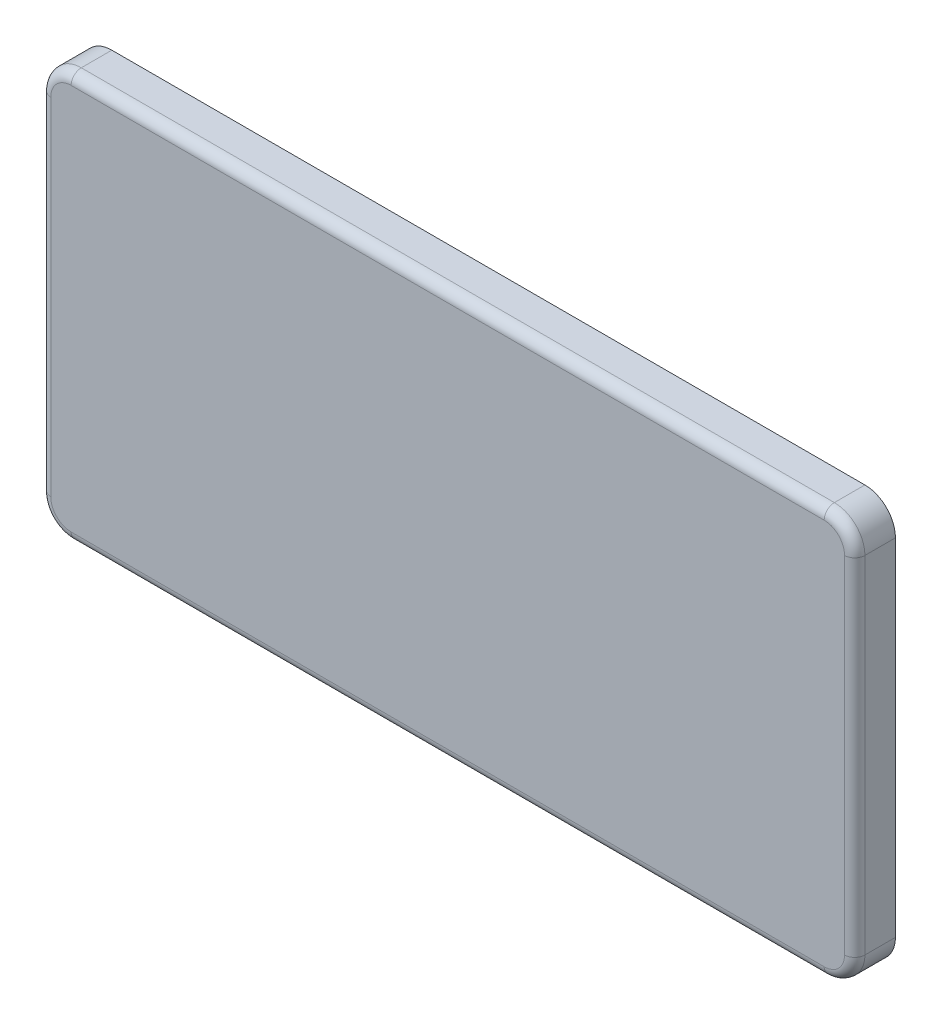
ISO-10303-21;
HEADER;
FILE_DESCRIPTION(('STEP AP214'),'2;1');
FILE_NAME('part.step','',(''),(''),'','','');
FILE_SCHEMA(('AUTOMOTIVE_DESIGN { 1 0 10303 214 1 1 1 1 }'));
ENDSEC;
DATA;
#1=APPLICATION_CONTEXT('core data for automotive mechanical design processes');
#2=APPLICATION_PROTOCOL_DEFINITION('international standard','automotive_design',2000,#1);
#3=PRODUCT_CONTEXT('',#1,'mechanical');
#4=PRODUCT('Part','Part','',(#3));
#5=PRODUCT_RELATED_PRODUCT_CATEGORY('part','',(#4));
#6=PRODUCT_DEFINITION_FORMATION('','',#4);
#7=PRODUCT_DEFINITION_CONTEXT('part definition',#1,'design');
#8=PRODUCT_DEFINITION('design','',#6,#7);
#9=PRODUCT_DEFINITION_SHAPE('','',#8);
#10=(LENGTH_UNIT() NAMED_UNIT(*) SI_UNIT(.MILLI.,.METRE.));
#11=(NAMED_UNIT(*) PLANE_ANGLE_UNIT() SI_UNIT($,.RADIAN.));
#12=(NAMED_UNIT(*) SI_UNIT($,.STERADIAN.) SOLID_ANGLE_UNIT());
#13=UNCERTAINTY_MEASURE_WITH_UNIT(LENGTH_MEASURE(1.E-05),#10,'distance_accuracy_value','');
#14=(GEOMETRIC_REPRESENTATION_CONTEXT(3) GLOBAL_UNCERTAINTY_ASSIGNED_CONTEXT((#13)) GLOBAL_UNIT_ASSIGNED_CONTEXT((#10,
#11,#12)) REPRESENTATION_CONTEXT('',''));
#15=CARTESIAN_POINT('',(0.,0.,0.));
#16=DIRECTION('',(0.,0.,1.));
#17=DIRECTION('',(1.,0.,0.));
#18=AXIS2_PLACEMENT_3D('',#15,#16,#17);
#19=CARTESIAN_POINT('',(57.,-17.,4.));
#20=DIRECTION('',(0.,0.,-1.));
#21=DIRECTION('',(-1.,0.,0.));
#22=AXIS2_PLACEMENT_3D('',#19,#20,#21);
#23=CYLINDRICAL_SURFACE('',#22,3.);
#24=DIRECTION('',(0.,0.,-1.));
#25=VECTOR('',#24,1.);
#26=CARTESIAN_POINT('',(60.0000000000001,-17.,4.));
#27=LINE('',#26,#25);
#28=CARTESIAN_POINT('',(60.0000000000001,-17.,3.));
#29=VERTEX_POINT('',#28);
#30=CARTESIAN_POINT('',(60.0000000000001,-17.,0.));
#31=VERTEX_POINT('',#30);
#32=EDGE_CURVE('E118',#29,#31,#27,.T.);
#33=ORIENTED_EDGE('',*,*,#32,.F.);
#34=CARTESIAN_POINT('',(57.,-17.,3.));
#35=DIRECTION('',(0.,0.,1.));
#36=DIRECTION('',(1.,0.,0.));
#37=AXIS2_PLACEMENT_3D('',#34,#35,#36);
#38=CIRCLE('',#37,3.);
#39=CARTESIAN_POINT('',(57.,-20.,3.));
#40=VERTEX_POINT('',#39);
#41=EDGE_CURVE('E11',#29,#40,#38,.F.);
#42=ORIENTED_EDGE('',*,*,#41,.T.);
#43=DIRECTION('',(0.,0.,-1.));
#44=VECTOR('',#43,1.);
#45=CARTESIAN_POINT('',(57.,-20.,4.));
#46=LINE('',#45,#44);
#47=CARTESIAN_POINT('',(57.,-20.,0.));
#48=VERTEX_POINT('',#47);
#49=EDGE_CURVE('E139',#40,#48,#46,.T.);
#50=ORIENTED_EDGE('',*,*,#49,.T.);
#51=CARTESIAN_POINT('',(57.,-17.,0.));
#52=DIRECTION('',(0.,0.,1.));
#53=DIRECTION('',(1.,0.,0.));
#54=AXIS2_PLACEMENT_3D('',#51,#52,#53);
#55=CIRCLE('',#54,3.);
#56=EDGE_CURVE('E133',#48,#31,#55,.T.);
#57=ORIENTED_EDGE('',*,*,#56,.T.);
#58=EDGE_LOOP('',(#33,#42,#50,#57));
#59=FACE_BOUND('',#58,.T.);
#60=ADVANCED_FACE('F30',(#59),#23,.T.);
#61=CARTESIAN_POINT('',(60.0000000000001,17.,4.));
#62=DIRECTION('',(-1.,0.,0.));
#63=DIRECTION('',(0.,0.,1.));
#64=AXIS2_PLACEMENT_3D('',#61,#62,#63);
#65=PLANE('',#64);
#66=DIRECTION('',(0.,0.,-1.));
#67=VECTOR('',#66,1.);
#68=CARTESIAN_POINT('',(60.0000000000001,17.,4.));
#69=LINE('',#68,#67);
#70=CARTESIAN_POINT('',(60.0000000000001,17.,3.));
#71=VERTEX_POINT('',#70);
#72=CARTESIAN_POINT('',(60.0000000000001,17.,0.));
#73=VERTEX_POINT('',#72);
#74=EDGE_CURVE('E127',#71,#73,#69,.T.);
#75=ORIENTED_EDGE('',*,*,#74,.F.);
#76=DIRECTION('',(0.,1.,0.));
#77=VECTOR('',#76,1.);
#78=CARTESIAN_POINT('',(60.0000000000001,-17.,3.));
#79=LINE('',#78,#77);
#80=EDGE_CURVE('E39',#71,#29,#79,.F.);
#81=ORIENTED_EDGE('',*,*,#80,.T.);
#82=ORIENTED_EDGE('',*,*,#32,.T.);
#83=DIRECTION('',(0.,1.,0.));
#84=VECTOR('',#83,1.);
#85=CARTESIAN_POINT('',(60.0000000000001,17.,0.));
#86=LINE('',#85,#84);
#87=EDGE_CURVE('E121',#31,#73,#86,.T.);
#88=ORIENTED_EDGE('',*,*,#87,.T.);
#89=EDGE_LOOP('',(#75,#81,#82,#88));
#90=FACE_BOUND('',#89,.T.);
#91=ADVANCED_FACE('F120',(#90),#65,.F.);
#92=CARTESIAN_POINT('',(57.,17.,4.));
#93=DIRECTION('',(0.,0.,-1.));
#94=DIRECTION('',(-1.,0.,0.));
#95=AXIS2_PLACEMENT_3D('',#92,#93,#94);
#96=CYLINDRICAL_SURFACE('',#95,3.);
#97=DIRECTION('',(0.,0.,-1.));
#98=VECTOR('',#97,1.);
#99=CARTESIAN_POINT('',(57.,20.,4.));
#100=LINE('',#99,#98);
#101=CARTESIAN_POINT('',(57.,20.,3.));
#102=VERTEX_POINT('',#101);
#103=CARTESIAN_POINT('',(57.,20.,0.));
#104=VERTEX_POINT('',#103);
#105=EDGE_CURVE('E169',#102,#104,#100,.T.);
#106=ORIENTED_EDGE('',*,*,#105,.F.);
#107=CARTESIAN_POINT('',(57.,17.,3.));
#108=DIRECTION('',(0.,0.,1.));
#109=DIRECTION('',(1.,0.,0.));
#110=AXIS2_PLACEMENT_3D('',#107,#108,#109);
#111=CIRCLE('',#110,3.);
#112=EDGE_CURVE('E54',#102,#71,#111,.F.);
#113=ORIENTED_EDGE('',*,*,#112,.T.);
#114=ORIENTED_EDGE('',*,*,#74,.T.);
#115=CARTESIAN_POINT('',(57.,17.,0.));
#116=DIRECTION('',(0.,0.,1.));
#117=DIRECTION('',(1.,0.,0.));
#118=AXIS2_PLACEMENT_3D('',#115,#116,#117);
#119=CIRCLE('',#118,3.);
#120=EDGE_CURVE('E136',#73,#104,#119,.T.);
#121=ORIENTED_EDGE('',*,*,#120,.T.);
#122=EDGE_LOOP('',(#106,#113,#114,#121));
#123=FACE_BOUND('',#122,.T.);
#124=ADVANCED_FACE('F272',(#123),#96,.T.);
#125=CARTESIAN_POINT('',(-17.,20.,4.));
#126=DIRECTION('',(0.,-1.,0.));
#127=DIRECTION('',(0.,0.,-1.));
#128=AXIS2_PLACEMENT_3D('',#125,#126,#127);
#129=PLANE('',#128);
#130=DIRECTION('',(0.,0.,-1.));
#131=VECTOR('',#130,1.);
#132=CARTESIAN_POINT('',(-17.,20.,4.));
#133=LINE('',#132,#131);
#134=CARTESIAN_POINT('',(-17.,20.,3.));
#135=VERTEX_POINT('',#134);
#136=CARTESIAN_POINT('',(-17.,20.,0.));
#137=VERTEX_POINT('',#136);
#138=EDGE_CURVE('E167',#135,#137,#133,.T.);
#139=ORIENTED_EDGE('',*,*,#138,.F.);
#140=DIRECTION('',(-1.,0.,0.));
#141=VECTOR('',#140,1.);
#142=CARTESIAN_POINT('',(57.,20.,3.));
#143=LINE('',#142,#141);
#144=EDGE_CURVE('E197',#135,#102,#143,.F.);
#145=ORIENTED_EDGE('',*,*,#144,.T.);
#146=ORIENTED_EDGE('',*,*,#105,.T.);
#147=DIRECTION('',(-1.,0.,0.));
#148=VECTOR('',#147,1.);
#149=CARTESIAN_POINT('',(-17.,20.,0.));
#150=LINE('',#149,#148);
#151=EDGE_CURVE('E146',#104,#137,#150,.T.);
#152=ORIENTED_EDGE('',*,*,#151,.T.);
#153=EDGE_LOOP('',(#139,#145,#146,#152));
#154=FACE_BOUND('',#153,.T.);
#155=ADVANCED_FACE('F270',(#154),#129,.F.);
#156=CARTESIAN_POINT('',(-17.,17.,4.));
#157=DIRECTION('',(0.,0.,-1.));
#158=DIRECTION('',(-1.,0.,0.));
#159=AXIS2_PLACEMENT_3D('',#156,#157,#158);
#160=CYLINDRICAL_SURFACE('',#159,3.);
#161=DIRECTION('',(0.,0.,-1.));
#162=VECTOR('',#161,1.);
#163=CARTESIAN_POINT('',(-20.,17.,4.));
#164=LINE('',#163,#162);
#165=CARTESIAN_POINT('',(-20.,17.,3.));
#166=VERTEX_POINT('',#165);
#167=CARTESIAN_POINT('',(-20.,17.,0.));
#168=VERTEX_POINT('',#167);
#169=EDGE_CURVE('E165',#166,#168,#164,.T.);
#170=ORIENTED_EDGE('',*,*,#169,.F.);
#171=CARTESIAN_POINT('',(-17.,17.,3.));
#172=DIRECTION('',(0.,0.,1.));
#173=DIRECTION('',(1.,0.,0.));
#174=AXIS2_PLACEMENT_3D('',#171,#172,#173);
#175=CIRCLE('',#174,3.);
#176=EDGE_CURVE('E195',#166,#135,#175,.F.);
#177=ORIENTED_EDGE('',*,*,#176,.T.);
#178=ORIENTED_EDGE('',*,*,#138,.T.);
#179=CARTESIAN_POINT('',(-17.,17.,0.));
#180=DIRECTION('',(0.,0.,1.));
#181=DIRECTION('',(-1.,0.,0.));
#182=AXIS2_PLACEMENT_3D('',#179,#180,#181);
#183=CIRCLE('',#182,3.);
#184=EDGE_CURVE('E149',#137,#168,#183,.T.);
#185=ORIENTED_EDGE('',*,*,#184,.T.);
#186=EDGE_LOOP('',(#170,#177,#178,#185));
#187=FACE_BOUND('',#186,.T.);
#188=ADVANCED_FACE('F268',(#187),#160,.T.);
#189=CARTESIAN_POINT('',(-20.,-17.,4.));
#190=DIRECTION('',(1.,0.,0.));
#191=DIRECTION('',(0.,0.,-1.));
#192=AXIS2_PLACEMENT_3D('',#189,#190,#191);
#193=PLANE('',#192);
#194=DIRECTION('',(0.,0.,-1.));
#195=VECTOR('',#194,1.);
#196=CARTESIAN_POINT('',(-20.,-17.,4.));
#197=LINE('',#196,#195);
#198=CARTESIAN_POINT('',(-20.,-17.,3.));
#199=VERTEX_POINT('',#198);
#200=CARTESIAN_POINT('',(-20.,-17.,0.));
#201=VERTEX_POINT('',#200);
#202=EDGE_CURVE('E163',#199,#201,#197,.T.);
#203=ORIENTED_EDGE('',*,*,#202,.F.);
#204=DIRECTION('',(0.,-1.,0.));
#205=VECTOR('',#204,1.);
#206=CARTESIAN_POINT('',(-20.,17.,3.));
#207=LINE('',#206,#205);
#208=EDGE_CURVE('E193',#199,#166,#207,.F.);
#209=ORIENTED_EDGE('',*,*,#208,.T.);
#210=ORIENTED_EDGE('',*,*,#169,.T.);
#211=DIRECTION('',(0.,-1.,0.));
#212=VECTOR('',#211,1.);
#213=CARTESIAN_POINT('',(-20.,-17.,0.));
#214=LINE('',#213,#212);
#215=EDGE_CURVE('E152',#168,#201,#214,.T.);
#216=ORIENTED_EDGE('',*,*,#215,.T.);
#217=EDGE_LOOP('',(#203,#209,#210,#216));
#218=FACE_BOUND('',#217,.T.);
#219=ADVANCED_FACE('F256',(#218),#193,.F.);
#220=CARTESIAN_POINT('',(-17.,-17.,4.));
#221=DIRECTION('',(0.,0.,-1.));
#222=DIRECTION('',(-1.,0.,0.));
#223=AXIS2_PLACEMENT_3D('',#220,#221,#222);
#224=CYLINDRICAL_SURFACE('',#223,3.);
#225=DIRECTION('',(0.,0.,-1.));
#226=VECTOR('',#225,1.);
#227=CARTESIAN_POINT('',(-17.,-20.,4.));
#228=LINE('',#227,#226);
#229=CARTESIAN_POINT('',(-17.,-20.,3.));
#230=VERTEX_POINT('',#229);
#231=CARTESIAN_POINT('',(-17.,-20.,0.));
#232=VERTEX_POINT('',#231);
#233=EDGE_CURVE('E161',#230,#232,#228,.T.);
#234=ORIENTED_EDGE('',*,*,#233,.F.);
#235=CARTESIAN_POINT('',(-17.,-17.,3.));
#236=DIRECTION('',(0.,0.,1.));
#237=DIRECTION('',(1.,0.,0.));
#238=AXIS2_PLACEMENT_3D('',#235,#236,#237);
#239=CIRCLE('',#238,3.);
#240=EDGE_CURVE('E191',#230,#199,#239,.F.);
#241=ORIENTED_EDGE('',*,*,#240,.T.);
#242=ORIENTED_EDGE('',*,*,#202,.T.);
#243=CARTESIAN_POINT('',(-17.,-17.,0.));
#244=DIRECTION('',(0.,0.,1.));
#245=DIRECTION('',(-1.,0.,0.));
#246=AXIS2_PLACEMENT_3D('',#243,#244,#245);
#247=CIRCLE('',#246,3.);
#248=EDGE_CURVE('E155',#201,#232,#247,.T.);
#249=ORIENTED_EDGE('',*,*,#248,.T.);
#250=EDGE_LOOP('',(#234,#241,#242,#249));
#251=FACE_BOUND('',#250,.T.);
#252=ADVANCED_FACE('F253',(#251),#224,.T.);
#253=CARTESIAN_POINT('',(57.,-20.,4.));
#254=DIRECTION('',(0.,1.,0.));
#255=DIRECTION('',(-1.,0.,0.));
#256=AXIS2_PLACEMENT_3D('',#253,#254,#255);
#257=PLANE('',#256);
#258=ORIENTED_EDGE('',*,*,#49,.F.);
#259=DIRECTION('',(1.,0.,0.));
#260=VECTOR('',#259,1.);
#261=CARTESIAN_POINT('',(-17.,-20.,3.));
#262=LINE('',#261,#260);
#263=EDGE_CURVE('E188',#40,#230,#262,.F.);
#264=ORIENTED_EDGE('',*,*,#263,.T.);
#265=ORIENTED_EDGE('',*,*,#233,.T.);
#266=DIRECTION('',(1.,0.,0.));
#267=VECTOR('',#266,1.);
#268=CARTESIAN_POINT('',(57.,-20.,0.));
#269=LINE('',#268,#267);
#270=EDGE_CURVE('E158',#232,#48,#269,.T.);
#271=ORIENTED_EDGE('',*,*,#270,.T.);
#272=EDGE_LOOP('',(#258,#264,#265,#271));
#273=FACE_BOUND('',#272,.T.);
#274=ADVANCED_FACE('F240',(#273),#257,.F.);
#275=CARTESIAN_POINT('',(57.,-17.,4.));
#276=DIRECTION('',(0.,0.,1.));
#277=DIRECTION('',(1.,0.,0.));
#278=AXIS2_PLACEMENT_3D('',#275,#276,#277);
#279=PLANE('',#278);
#280=CARTESIAN_POINT('',(-17.,-17.,4.));
#281=DIRECTION('',(0.,0.,1.));
#282=DIRECTION('',(1.,0.,0.));
#283=AXIS2_PLACEMENT_3D('',#280,#281,#282);
#284=CIRCLE('',#283,2.);
#285=CARTESIAN_POINT('',(-19.,-17.,4.));
#286=VERTEX_POINT('',#285);
#287=CARTESIAN_POINT('',(-17.,-19.,4.));
#288=VERTEX_POINT('',#287);
#289=EDGE_CURVE('E183',#286,#288,#284,.T.);
#290=ORIENTED_EDGE('',*,*,#289,.T.);
#291=DIRECTION('',(1.,0.,0.));
#292=VECTOR('',#291,1.);
#293=CARTESIAN_POINT('',(57.,-19.,4.));
#294=LINE('',#293,#292);
#295=CARTESIAN_POINT('',(57.,-19.,4.));
#296=VERTEX_POINT('',#295);
#297=EDGE_CURVE('E185',#288,#296,#294,.T.);
#298=ORIENTED_EDGE('',*,*,#297,.T.);
#299=CARTESIAN_POINT('',(57.,-17.,4.));
#300=DIRECTION('',(0.,0.,1.));
#301=DIRECTION('',(1.,0.,0.));
#302=AXIS2_PLACEMENT_3D('',#299,#300,#301);
#303=CIRCLE('',#302,2.);
#304=CARTESIAN_POINT('',(59.,-17.,4.));
#305=VERTEX_POINT('',#304);
#306=EDGE_CURVE('E126',#296,#305,#303,.T.);
#307=ORIENTED_EDGE('',*,*,#306,.T.);
#308=DIRECTION('',(0.,1.,0.));
#309=VECTOR('',#308,1.);
#310=CARTESIAN_POINT('',(59.,17.,4.));
#311=LINE('',#310,#309);
#312=CARTESIAN_POINT('',(59.,17.,4.));
#313=VERTEX_POINT('',#312);
#314=EDGE_CURVE('E173',#305,#313,#311,.T.);
#315=ORIENTED_EDGE('',*,*,#314,.T.);
#316=CARTESIAN_POINT('',(57.,17.,4.));
#317=DIRECTION('',(0.,0.,1.));
#318=DIRECTION('',(1.,0.,0.));
#319=AXIS2_PLACEMENT_3D('',#316,#317,#318);
#320=CIRCLE('',#319,2.);
#321=CARTESIAN_POINT('',(57.,19.,4.));
#322=VERTEX_POINT('',#321);
#323=EDGE_CURVE('E175',#313,#322,#320,.T.);
#324=ORIENTED_EDGE('',*,*,#323,.T.);
#325=DIRECTION('',(-1.,0.,0.));
#326=VECTOR('',#325,1.);
#327=CARTESIAN_POINT('',(-17.,19.,4.));
#328=LINE('',#327,#326);
#329=CARTESIAN_POINT('',(-17.,19.,4.));
#330=VERTEX_POINT('',#329);
#331=EDGE_CURVE('E177',#322,#330,#328,.T.);
#332=ORIENTED_EDGE('',*,*,#331,.T.);
#333=CARTESIAN_POINT('',(-17.,17.,4.));
#334=DIRECTION('',(0.,0.,1.));
#335=DIRECTION('',(1.,0.,0.));
#336=AXIS2_PLACEMENT_3D('',#333,#334,#335);
#337=CIRCLE('',#336,2.);
#338=CARTESIAN_POINT('',(-19.,17.,4.));
#339=VERTEX_POINT('',#338);
#340=EDGE_CURVE('E179',#330,#339,#337,.T.);
#341=ORIENTED_EDGE('',*,*,#340,.T.);
#342=DIRECTION('',(0.,-1.,0.));
#343=VECTOR('',#342,1.);
#344=CARTESIAN_POINT('',(-19.,-17.,4.));
#345=LINE('',#344,#343);
#346=EDGE_CURVE('E181',#339,#286,#345,.T.);
#347=ORIENTED_EDGE('',*,*,#346,.T.);
#348=EDGE_LOOP('',(#290,#298,#307,#315,#324,#332,#341,#347));
#349=FACE_BOUND('',#348,.T.);
#350=ADVANCED_FACE('F228',(#349),#279,.T.);
#351=CARTESIAN_POINT('',(57.,-17.,0.));
#352=DIRECTION('',(0.,0.,1.));
#353=DIRECTION('',(1.,0.,0.));
#354=AXIS2_PLACEMENT_3D('',#351,#352,#353);
#355=PLANE('',#354);
#356=ORIENTED_EDGE('',*,*,#56,.F.);
#357=ORIENTED_EDGE('',*,*,#270,.F.);
#358=ORIENTED_EDGE('',*,*,#248,.F.);
#359=ORIENTED_EDGE('',*,*,#215,.F.);
#360=ORIENTED_EDGE('',*,*,#184,.F.);
#361=ORIENTED_EDGE('',*,*,#151,.F.);
#362=ORIENTED_EDGE('',*,*,#120,.F.);
#363=ORIENTED_EDGE('',*,*,#87,.F.);
#364=EDGE_LOOP('',(#356,#357,#358,#359,#360,#361,#362,#363));
#365=FACE_BOUND('',#364,.T.);
#366=ADVANCED_FACE('F131',(#365),#355,.F.);
#367=CARTESIAN_POINT('',(57.,19.,3.));
#368=DIRECTION('',(1.,0.,0.));
#369=DIRECTION('',(0.,0.,-1.));
#370=AXIS2_PLACEMENT_3D('',#367,#368,#369);
#371=CYLINDRICAL_SURFACE('',#370,1.);
#372=CARTESIAN_POINT('',(57.,19.,3.));
#373=DIRECTION('',(1.,0.,0.));
#374=DIRECTION('',(0.,0.,-1.));
#375=AXIS2_PLACEMENT_3D('',#372,#373,#374);
#376=CIRCLE('',#375,1.);
#377=EDGE_CURVE('E143',#102,#322,#376,.T.);
#378=ORIENTED_EDGE('',*,*,#377,.F.);
#379=ORIENTED_EDGE('',*,*,#144,.F.);
#380=CARTESIAN_POINT('',(-17.,19.,3.));
#381=DIRECTION('',(-1.,0.,0.));
#382=DIRECTION('',(0.,-1.,0.));
#383=AXIS2_PLACEMENT_3D('',#380,#381,#382);
#384=CIRCLE('',#383,1.);
#385=EDGE_CURVE('E34',#330,#135,#384,.T.);
#386=ORIENTED_EDGE('',*,*,#385,.F.);
#387=ORIENTED_EDGE('',*,*,#331,.F.);
#388=EDGE_LOOP('',(#378,#379,#386,#387));
#389=FACE_BOUND('',#388,.T.);
#390=ADVANCED_FACE('F32',(#389),#371,.T.);
#391=CARTESIAN_POINT('',(-17.,17.,3.));
#392=DIRECTION('',(0.,0.,1.));
#393=DIRECTION('',(1.,0.,0.));
#394=AXIS2_PLACEMENT_3D('',#391,#392,#393);
#395=TOROIDAL_SURFACE('',#394,2.,1.);
#396=ORIENTED_EDGE('',*,*,#385,.T.);
#397=ORIENTED_EDGE('',*,*,#176,.F.);
#398=CARTESIAN_POINT('',(-19.,17.,3.));
#399=DIRECTION('',(0.,-1.,0.));
#400=DIRECTION('',(0.,0.,-1.));
#401=AXIS2_PLACEMENT_3D('',#398,#399,#400);
#402=CIRCLE('',#401,1.);
#403=EDGE_CURVE('E214',#339,#166,#402,.T.);
#404=ORIENTED_EDGE('',*,*,#403,.F.);
#405=ORIENTED_EDGE('',*,*,#340,.F.);
#406=EDGE_LOOP('',(#396,#397,#404,#405));
#407=FACE_BOUND('',#406,.T.);
#408=ADVANCED_FACE('F265',(#407),#395,.T.);
#409=CARTESIAN_POINT('',(57.,17.,3.));
#410=DIRECTION('',(0.,0.,1.));
#411=DIRECTION('',(1.,0.,0.));
#412=AXIS2_PLACEMENT_3D('',#409,#410,#411);
#413=TOROIDAL_SURFACE('',#412,2.,1.);
#414=ORIENTED_EDGE('',*,*,#377,.T.);
#415=ORIENTED_EDGE('',*,*,#323,.F.);
#416=CARTESIAN_POINT('',(59.,17.,3.));
#417=DIRECTION('',(0.,-1.,0.));
#418=DIRECTION('',(1.,0.,0.));
#419=AXIS2_PLACEMENT_3D('',#416,#417,#418);
#420=CIRCLE('',#419,1.);
#421=EDGE_CURVE('E211',#71,#313,#420,.T.);
#422=ORIENTED_EDGE('',*,*,#421,.F.);
#423=ORIENTED_EDGE('',*,*,#112,.F.);
#424=EDGE_LOOP('',(#414,#415,#422,#423));
#425=FACE_BOUND('',#424,.T.);
#426=ADVANCED_FACE('F220',(#425),#413,.T.);
#427=CARTESIAN_POINT('',(-19.,-17.,3.));
#428=DIRECTION('',(0.,1.,0.));
#429=DIRECTION('',(0.,0.,1.));
#430=AXIS2_PLACEMENT_3D('',#427,#428,#429);
#431=CYLINDRICAL_SURFACE('',#430,1.);
#432=ORIENTED_EDGE('',*,*,#403,.T.);
#433=ORIENTED_EDGE('',*,*,#208,.F.);
#434=CARTESIAN_POINT('',(-19.,-17.,3.));
#435=DIRECTION('',(0.,-1.,0.));
#436=DIRECTION('',(1.,0.,0.));
#437=AXIS2_PLACEMENT_3D('',#434,#435,#436);
#438=CIRCLE('',#437,1.);
#439=EDGE_CURVE('E208',#286,#199,#438,.T.);
#440=ORIENTED_EDGE('',*,*,#439,.F.);
#441=ORIENTED_EDGE('',*,*,#346,.F.);
#442=EDGE_LOOP('',(#432,#433,#440,#441));
#443=FACE_BOUND('',#442,.T.);
#444=ADVANCED_FACE('F261',(#443),#431,.T.);
#445=CARTESIAN_POINT('',(59.,-17.,3.));
#446=DIRECTION('',(0.,-1.,0.));
#447=DIRECTION('',(0.,0.,-1.));
#448=AXIS2_PLACEMENT_3D('',#445,#446,#447);
#449=CYLINDRICAL_SURFACE('',#448,1.);
#450=ORIENTED_EDGE('',*,*,#421,.T.);
#451=ORIENTED_EDGE('',*,*,#314,.F.);
#452=CARTESIAN_POINT('',(59.,-17.,3.));
#453=DIRECTION('',(0.,-1.,0.));
#454=DIRECTION('',(0.,0.,-1.));
#455=AXIS2_PLACEMENT_3D('',#452,#453,#454);
#456=CIRCLE('',#455,1.);
#457=EDGE_CURVE('E205',#29,#305,#456,.T.);
#458=ORIENTED_EDGE('',*,*,#457,.F.);
#459=ORIENTED_EDGE('',*,*,#80,.F.);
#460=EDGE_LOOP('',(#450,#451,#458,#459));
#461=FACE_BOUND('',#460,.T.);
#462=ADVANCED_FACE('F233',(#461),#449,.T.);
#463=CARTESIAN_POINT('',(-17.,-17.,3.));
#464=DIRECTION('',(0.,0.,1.));
#465=DIRECTION('',(1.,0.,0.));
#466=AXIS2_PLACEMENT_3D('',#463,#464,#465);
#467=TOROIDAL_SURFACE('',#466,2.,1.);
#468=ORIENTED_EDGE('',*,*,#439,.T.);
#469=ORIENTED_EDGE('',*,*,#240,.F.);
#470=CARTESIAN_POINT('',(-17.,-19.,3.));
#471=DIRECTION('',(1.,0.,0.));
#472=DIRECTION('',(0.,0.,-1.));
#473=AXIS2_PLACEMENT_3D('',#470,#471,#472);
#474=CIRCLE('',#473,1.);
#475=EDGE_CURVE('E203',#288,#230,#474,.T.);
#476=ORIENTED_EDGE('',*,*,#475,.F.);
#477=ORIENTED_EDGE('',*,*,#289,.F.);
#478=EDGE_LOOP('',(#468,#469,#476,#477));
#479=FACE_BOUND('',#478,.T.);
#480=ADVANCED_FACE('F249',(#479),#467,.T.);
#481=CARTESIAN_POINT('',(57.,-17.,3.));
#482=DIRECTION('',(0.,0.,1.));
#483=DIRECTION('',(1.,0.,0.));
#484=AXIS2_PLACEMENT_3D('',#481,#482,#483);
#485=TOROIDAL_SURFACE('',#484,2.,1.);
#486=ORIENTED_EDGE('',*,*,#457,.T.);
#487=ORIENTED_EDGE('',*,*,#306,.F.);
#488=CARTESIAN_POINT('',(57.,-19.,3.));
#489=DIRECTION('',(-1.,0.,0.));
#490=DIRECTION('',(0.,-1.,0.));
#491=AXIS2_PLACEMENT_3D('',#488,#489,#490);
#492=CIRCLE('',#491,1.);
#493=EDGE_CURVE('E201',#40,#296,#492,.T.);
#494=ORIENTED_EDGE('',*,*,#493,.F.);
#495=ORIENTED_EDGE('',*,*,#41,.F.);
#496=EDGE_LOOP('',(#486,#487,#494,#495));
#497=FACE_BOUND('',#496,.T.);
#498=ADVANCED_FACE('F236',(#497),#485,.T.);
#499=CARTESIAN_POINT('',(57.,-19.,3.));
#500=DIRECTION('',(-1.,0.,0.));
#501=DIRECTION('',(0.,-1.,0.));
#502=AXIS2_PLACEMENT_3D('',#499,#500,#501);
#503=CYLINDRICAL_SURFACE('',#502,1.);
#504=ORIENTED_EDGE('',*,*,#475,.T.);
#505=ORIENTED_EDGE('',*,*,#263,.F.);
#506=ORIENTED_EDGE('',*,*,#493,.T.);
#507=ORIENTED_EDGE('',*,*,#297,.F.);
#508=EDGE_LOOP('',(#504,#505,#506,#507));
#509=FACE_BOUND('',#508,.T.);
#510=ADVANCED_FACE('F243',(#509),#503,.T.);
#511=CLOSED_SHELL('',(#60,#91,#124,#155,#188,#219,#252,#274,#350,#366,#390,#408,#426,#444,#462,
#480,#498,#510));
#512=MANIFOLD_SOLID_BREP('B2',#511);
#513=ADVANCED_BREP_SHAPE_REPRESENTATION('',(#18,#512),#14);
#514=SHAPE_DEFINITION_REPRESENTATION(#9,#513);
ENDSEC;
END-ISO-10303-21;
